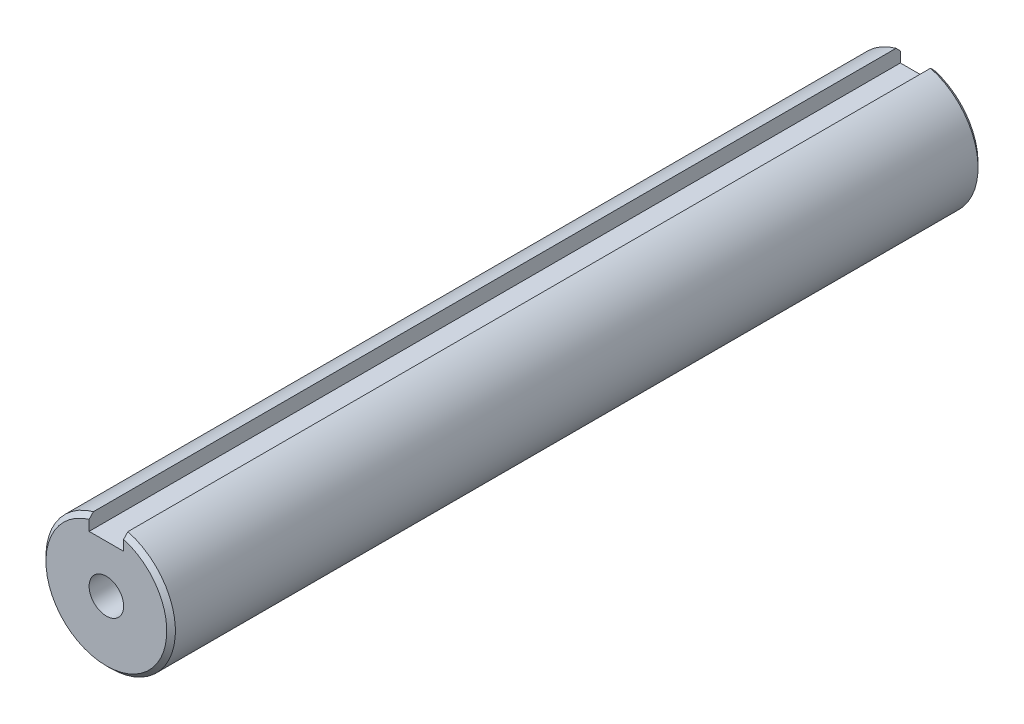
from build123d import *

# Parameters (mm, degrees)
EXTRUSION1_DEPTH                 = 94
CHANFREIN1_SIZE                  = 1
TROU_TARAUD_M8X1_251_D           = 6.8
TROU_TARAUD_M8X1_251_DEPTH       = 25
TROU_TARAUD_M8X1_251_CBORE_D     = 8
TROU_TARAUD_M8X1_251_CBORE_DEPTH = 20
TROU_TARAUD_M8X1_251_TIP         = 2.042926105
TROU_TARAUD_M8X1_253_D           = 6.8
TROU_TARAUD_M8X1_253_DEPTH       = 25
TROU_TARAUD_M8X1_253_CBORE_D     = 8
TROU_TARAUD_M8X1_253_CBORE_DEPTH = 20
TROU_TARAUD_M8X1_253_TIP         = 2.042926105


with BuildPart() as part:
    # Esquisse1 → Extrusion1 (new, symmetric)
    with BuildSketch(Plane.XY):
        with BuildLine():
            Line((-4, 14.456832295), (-4, 11))
            Line((-4, 11), (4, 11))
            Line((4, 11), (4, 14.456832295))
            ThreePointArc((4, 14.456832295), (0, -15), (-4, 14.456832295))
        make_face()
    extrude(amount=EXTRUSION1_DEPTH, both=True)

    # Chanfrein1
    chanfrein1_edges = [part.edges().sort_by_distance(p)[0] for p in [
        (0, -15, 94),
        (0, -15, -94),
    ]]
    chamfer(chanfrein1_edges, length=CHANFREIN1_SIZE)

    # Trou taraud_ M8x1.251
    with Locations(Plane.XY.offset(94)):
        with Locations((0, 0)):
            CounterBoreHole(TROU_TARAUD_M8X1_251_D / 2, TROU_TARAUD_M8X1_251_CBORE_D / 2, TROU_TARAUD_M8X1_251_CBORE_DEPTH, depth=TROU_TARAUD_M8X1_251_DEPTH)
            with Locations((0, 0, -(TROU_TARAUD_M8X1_251_DEPTH + TROU_TARAUD_M8X1_251_TIP / 2))):  # 118° drill point
                Cone(0, TROU_TARAUD_M8X1_251_D / 2, TROU_TARAUD_M8X1_251_TIP, mode=Mode.SUBTRACT)

    # Trou taraud_ M8x1.253
    with Locations(Plane(origin=(0, 0, -94), x_dir=(-1, 0, 0), z_dir=(0, 0, -1))):
        with Locations((0, 0)):
            CounterBoreHole(TROU_TARAUD_M8X1_253_D / 2, TROU_TARAUD_M8X1_253_CBORE_D / 2, TROU_TARAUD_M8X1_253_CBORE_DEPTH, depth=TROU_TARAUD_M8X1_253_DEPTH)
            with Locations((0, 0, -(TROU_TARAUD_M8X1_253_DEPTH + TROU_TARAUD_M8X1_253_TIP / 2))):  # 118° drill point
                Cone(0, TROU_TARAUD_M8X1_253_D / 2, TROU_TARAUD_M8X1_253_TIP, mode=Mode.SUBTRACT)


solid = part.part
